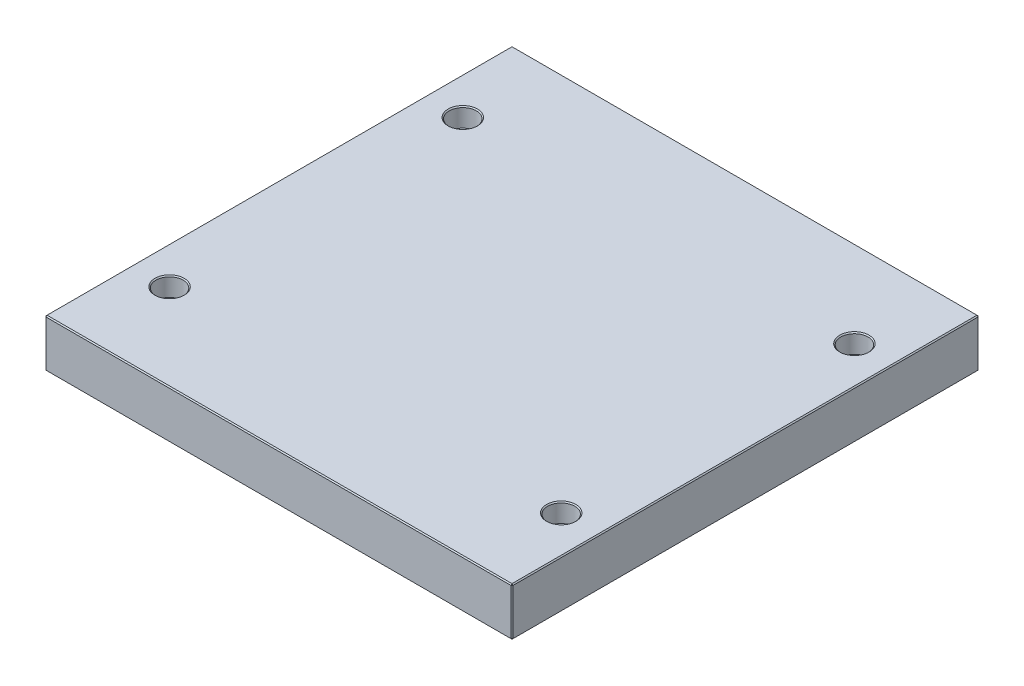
ISO-10303-21;
HEADER;
FILE_DESCRIPTION(('STEP AP214'),'2;1');
FILE_NAME('part.step','',(''),(''),'','','');
FILE_SCHEMA(('AUTOMOTIVE_DESIGN { 1 0 10303 214 1 1 1 1 }'));
ENDSEC;
DATA;
#1=APPLICATION_CONTEXT('core data for automotive mechanical design processes');
#2=APPLICATION_PROTOCOL_DEFINITION('international standard','automotive_design',2000,#1);
#3=PRODUCT_CONTEXT('',#1,'mechanical');
#4=PRODUCT('Part','Part','',(#3));
#5=PRODUCT_RELATED_PRODUCT_CATEGORY('part','',(#4));
#6=PRODUCT_DEFINITION_FORMATION('','',#4);
#7=PRODUCT_DEFINITION_CONTEXT('part definition',#1,'design');
#8=PRODUCT_DEFINITION('design','',#6,#7);
#9=PRODUCT_DEFINITION_SHAPE('','',#8);
#10=(LENGTH_UNIT() NAMED_UNIT(*) SI_UNIT(.MILLI.,.METRE.));
#11=(NAMED_UNIT(*) PLANE_ANGLE_UNIT() SI_UNIT($,.RADIAN.));
#12=(NAMED_UNIT(*) SI_UNIT($,.STERADIAN.) SOLID_ANGLE_UNIT());
#13=UNCERTAINTY_MEASURE_WITH_UNIT(LENGTH_MEASURE(1.E-05),#10,'distance_accuracy_value','');
#14=(GEOMETRIC_REPRESENTATION_CONTEXT(3) GLOBAL_UNCERTAINTY_ASSIGNED_CONTEXT((#13)) GLOBAL_UNIT_ASSIGNED_CONTEXT((#10,
#11,#12)) REPRESENTATION_CONTEXT('',''));
#15=CARTESIAN_POINT('',(0.,0.,0.));
#16=DIRECTION('',(0.,0.,1.));
#17=DIRECTION('',(1.,0.,0.));
#18=AXIS2_PLACEMENT_3D('',#15,#16,#17);
#19=CARTESIAN_POINT('',(-223.,46.,223.));
#20=DIRECTION('',(1.,0.,0.));
#21=DIRECTION('',(0.,0.,-1.));
#22=AXIS2_PLACEMENT_3D('',#19,#20,#21);
#23=PLANE('',#22);
#24=DIRECTION('',(0.,-1.,0.));
#25=VECTOR('',#24,1.);
#26=CARTESIAN_POINT('',(-223.,46.,-222.));
#27=LINE('',#26,#25);
#28=CARTESIAN_POINT('',(-223.,45.,-222.));
#29=VERTEX_POINT('',#28);
#30=CARTESIAN_POINT('',(-223.,1.,-222.));
#31=VERTEX_POINT('',#30);
#32=EDGE_CURVE('E115',#29,#31,#27,.T.);
#33=ORIENTED_EDGE('',*,*,#32,.T.);
#34=DIRECTION('',(0.,0.,1.));
#35=VECTOR('',#34,1.);
#36=CARTESIAN_POINT('',(-223.,1.,223.));
#37=LINE('',#36,#35);
#38=CARTESIAN_POINT('',(-223.,1.,222.));
#39=VERTEX_POINT('',#38);
#40=EDGE_CURVE('E111',#31,#39,#37,.T.);
#41=ORIENTED_EDGE('',*,*,#40,.T.);
#42=DIRECTION('',(0.,1.,0.));
#43=VECTOR('',#42,1.);
#44=CARTESIAN_POINT('',(-223.,46.,222.));
#45=LINE('',#44,#43);
#46=CARTESIAN_POINT('',(-223.,45.,222.));
#47=VERTEX_POINT('',#46);
#48=EDGE_CURVE('E104',#39,#47,#45,.T.);
#49=ORIENTED_EDGE('',*,*,#48,.T.);
#50=DIRECTION('',(0.,0.,-1.));
#51=VECTOR('',#50,1.);
#52=CARTESIAN_POINT('',(-223.,45.,-223.));
#53=LINE('',#52,#51);
#54=EDGE_CURVE('E108',#47,#29,#53,.T.);
#55=ORIENTED_EDGE('',*,*,#54,.T.);
#56=EDGE_LOOP('',(#33,#41,#49,#55));
#57=FACE_BOUND('',#56,.T.);
#58=ADVANCED_FACE('F16',(#57),#23,.F.);
#59=CARTESIAN_POINT('',(223.,46.,223.));
#60=DIRECTION('',(0.,0.,-1.));
#61=DIRECTION('',(-1.,0.,0.));
#62=AXIS2_PLACEMENT_3D('',#59,#60,#61);
#63=PLANE('',#62);
#64=DIRECTION('',(-1.,0.,0.));
#65=VECTOR('',#64,1.);
#66=CARTESIAN_POINT('',(-223.,45.,223.));
#67=LINE('',#66,#65);
#68=CARTESIAN_POINT('',(222.,45.,223.));
#69=VERTEX_POINT('',#68);
#70=CARTESIAN_POINT('',(-222.,45.,223.));
#71=VERTEX_POINT('',#70);
#72=EDGE_CURVE('E170',#69,#71,#67,.T.);
#73=ORIENTED_EDGE('',*,*,#72,.T.);
#74=DIRECTION('',(0.,-1.,0.));
#75=VECTOR('',#74,1.);
#76=CARTESIAN_POINT('',(-222.,46.,223.));
#77=LINE('',#76,#75);
#78=CARTESIAN_POINT('',(-222.,1.,223.));
#79=VERTEX_POINT('',#78);
#80=EDGE_CURVE('E123',#71,#79,#77,.T.);
#81=ORIENTED_EDGE('',*,*,#80,.T.);
#82=DIRECTION('',(1.,0.,0.));
#83=VECTOR('',#82,1.);
#84=CARTESIAN_POINT('',(223.,1.,223.));
#85=LINE('',#84,#83);
#86=CARTESIAN_POINT('',(222.,1.,223.));
#87=VERTEX_POINT('',#86);
#88=EDGE_CURVE('E174',#79,#87,#85,.T.);
#89=ORIENTED_EDGE('',*,*,#88,.T.);
#90=DIRECTION('',(0.,1.,0.));
#91=VECTOR('',#90,1.);
#92=CARTESIAN_POINT('',(222.,46.,223.));
#93=LINE('',#92,#91);
#94=EDGE_CURVE('E172',#87,#69,#93,.T.);
#95=ORIENTED_EDGE('',*,*,#94,.T.);
#96=EDGE_LOOP('',(#73,#81,#89,#95));
#97=FACE_BOUND('',#96,.T.);
#98=ADVANCED_FACE('F317',(#97),#63,.F.);
#99=CARTESIAN_POINT('',(223.,46.,223.));
#100=DIRECTION('',(-1.,0.,0.));
#101=DIRECTION('',(0.,0.,1.));
#102=AXIS2_PLACEMENT_3D('',#99,#100,#101);
#103=PLANE('',#102);
#104=DIRECTION('',(0.,0.,-1.));
#105=VECTOR('',#104,1.);
#106=CARTESIAN_POINT('',(223.,1.,223.));
#107=LINE('',#106,#105);
#108=CARTESIAN_POINT('',(223.,1.,222.));
#109=VERTEX_POINT('',#108);
#110=CARTESIAN_POINT('',(223.,1.,-222.));
#111=VERTEX_POINT('',#110);
#112=EDGE_CURVE('E165',#109,#111,#107,.T.);
#113=ORIENTED_EDGE('',*,*,#112,.T.);
#114=DIRECTION('',(0.,1.,0.));
#115=VECTOR('',#114,1.);
#116=CARTESIAN_POINT('',(223.,46.,-222.));
#117=LINE('',#116,#115);
#118=CARTESIAN_POINT('',(223.,45.,-222.));
#119=VERTEX_POINT('',#118);
#120=EDGE_CURVE('E167',#111,#119,#117,.T.);
#121=ORIENTED_EDGE('',*,*,#120,.T.);
#122=DIRECTION('',(0.,0.,1.));
#123=VECTOR('',#122,1.);
#124=CARTESIAN_POINT('',(223.,45.,223.));
#125=LINE('',#124,#123);
#126=CARTESIAN_POINT('',(223.,45.,222.));
#127=VERTEX_POINT('',#126);
#128=EDGE_CURVE('E161',#119,#127,#125,.T.);
#129=ORIENTED_EDGE('',*,*,#128,.T.);
#130=DIRECTION('',(0.,-1.,0.));
#131=VECTOR('',#130,1.);
#132=CARTESIAN_POINT('',(223.,46.,222.));
#133=LINE('',#132,#131);
#134=EDGE_CURVE('E163',#127,#109,#133,.T.);
#135=ORIENTED_EDGE('',*,*,#134,.T.);
#136=EDGE_LOOP('',(#113,#121,#129,#135));
#137=FACE_BOUND('',#136,.T.);
#138=ADVANCED_FACE('F323',(#137),#103,.F.);
#139=CARTESIAN_POINT('',(223.,46.,-223.));
#140=DIRECTION('',(0.,0.,1.));
#141=DIRECTION('',(1.,0.,0.));
#142=AXIS2_PLACEMENT_3D('',#139,#140,#141);
#143=PLANE('',#142);
#144=DIRECTION('',(0.,-1.,0.));
#145=VECTOR('',#144,1.);
#146=CARTESIAN_POINT('',(222.,46.,-223.));
#147=LINE('',#146,#145);
#148=CARTESIAN_POINT('',(222.,45.,-223.));
#149=VERTEX_POINT('',#148);
#150=CARTESIAN_POINT('',(222.,1.,-223.));
#151=VERTEX_POINT('',#150);
#152=EDGE_CURVE('E154',#149,#151,#147,.T.);
#153=ORIENTED_EDGE('',*,*,#152,.T.);
#154=DIRECTION('',(-1.,0.,0.));
#155=VECTOR('',#154,1.);
#156=CARTESIAN_POINT('',(223.,1.,-223.));
#157=LINE('',#156,#155);
#158=CARTESIAN_POINT('',(-222.,1.,-223.));
#159=VERTEX_POINT('',#158);
#160=EDGE_CURVE('E159',#151,#159,#157,.T.);
#161=ORIENTED_EDGE('',*,*,#160,.T.);
#162=DIRECTION('',(0.,1.,0.));
#163=VECTOR('',#162,1.);
#164=CARTESIAN_POINT('',(-222.,46.,-223.));
#165=LINE('',#164,#163);
#166=CARTESIAN_POINT('',(-222.,45.,-223.));
#167=VERTEX_POINT('',#166);
#168=EDGE_CURVE('E156',#159,#167,#165,.T.);
#169=ORIENTED_EDGE('',*,*,#168,.T.);
#170=DIRECTION('',(1.,0.,0.));
#171=VECTOR('',#170,1.);
#172=CARTESIAN_POINT('',(223.,45.,-223.));
#173=LINE('',#172,#171);
#174=EDGE_CURVE('E152',#167,#149,#173,.T.);
#175=ORIENTED_EDGE('',*,*,#174,.T.);
#176=EDGE_LOOP('',(#153,#161,#169,#175));
#177=FACE_BOUND('',#176,.T.);
#178=ADVANCED_FACE('F465',(#177),#143,.F.);
#179=CARTESIAN_POINT('',(0.,46.,0.));
#180=DIRECTION('',(0.,1.,0.));
#181=DIRECTION('',(0.,0.,1.));
#182=AXIS2_PLACEMENT_3D('',#179,#180,#181);
#183=PLANE('',#182);
#184=CARTESIAN_POINT('',(-187.,46.,140.));
#185=DIRECTION('',(0.,1.,0.));
#186=DIRECTION('',(0.,0.,1.));
#187=AXIS2_PLACEMENT_3D('',#184,#185,#186);
#188=CIRCLE('',#187,14.);
#189=CARTESIAN_POINT('',(-187.,46.,154.));
#190=VERTEX_POINT('',#189);
#191=EDGE_CURVE('E290',#190,#190,#188,.F.);
#192=ORIENTED_EDGE('',*,*,#191,.T.);
#193=EDGE_LOOP('',(#192));
#194=FACE_BOUND('',#193,.T.);
#195=CARTESIAN_POINT('',(187.,46.,140.));
#196=DIRECTION('',(0.,1.,0.));
#197=DIRECTION('',(0.,0.,1.));
#198=AXIS2_PLACEMENT_3D('',#195,#196,#197);
#199=CIRCLE('',#198,14.);
#200=CARTESIAN_POINT('',(187.,46.,154.));
#201=VERTEX_POINT('',#200);
#202=EDGE_CURVE('E287',#201,#201,#199,.F.);
#203=ORIENTED_EDGE('',*,*,#202,.T.);
#204=EDGE_LOOP('',(#203));
#205=FACE_BOUND('',#204,.T.);
#206=CARTESIAN_POINT('',(187.,46.,-140.));
#207=DIRECTION('',(0.,1.,0.));
#208=DIRECTION('',(0.,0.,1.));
#209=AXIS2_PLACEMENT_3D('',#206,#207,#208);
#210=CIRCLE('',#209,14.);
#211=CARTESIAN_POINT('',(187.,46.,-126.));
#212=VERTEX_POINT('',#211);
#213=EDGE_CURVE('E284',#212,#212,#210,.F.);
#214=ORIENTED_EDGE('',*,*,#213,.T.);
#215=EDGE_LOOP('',(#214));
#216=FACE_BOUND('',#215,.T.);
#217=CARTESIAN_POINT('',(-187.,46.,-140.));
#218=DIRECTION('',(0.,1.,0.));
#219=DIRECTION('',(0.,0.,1.));
#220=AXIS2_PLACEMENT_3D('',#217,#218,#219);
#221=CIRCLE('',#220,14.);
#222=CARTESIAN_POINT('',(-187.,46.,-126.));
#223=VERTEX_POINT('',#222);
#224=EDGE_CURVE('E281',#223,#223,#221,.F.);
#225=ORIENTED_EDGE('',*,*,#224,.T.);
#226=EDGE_LOOP('',(#225));
#227=FACE_BOUND('',#226,.T.);
#228=DIRECTION('',(0.,0.,-1.));
#229=VECTOR('',#228,1.);
#230=CARTESIAN_POINT('',(222.,46.,-223.));
#231=LINE('',#230,#229);
#232=CARTESIAN_POINT('',(222.,46.,222.));
#233=VERTEX_POINT('',#232);
#234=CARTESIAN_POINT('',(222.,46.,-222.));
#235=VERTEX_POINT('',#234);
#236=EDGE_CURVE('E31',#233,#235,#231,.T.);
#237=ORIENTED_EDGE('',*,*,#236,.T.);
#238=DIRECTION('',(-1.,0.,0.));
#239=VECTOR('',#238,1.);
#240=CARTESIAN_POINT('',(-223.,46.,-222.));
#241=LINE('',#240,#239);
#242=CARTESIAN_POINT('',(-222.,46.,-222.));
#243=VERTEX_POINT('',#242);
#244=EDGE_CURVE('E190',#235,#243,#241,.T.);
#245=ORIENTED_EDGE('',*,*,#244,.T.);
#246=DIRECTION('',(0.,0.,1.));
#247=VECTOR('',#246,1.);
#248=CARTESIAN_POINT('',(-222.,46.,223.));
#249=LINE('',#248,#247);
#250=CARTESIAN_POINT('',(-222.,46.,222.));
#251=VERTEX_POINT('',#250);
#252=EDGE_CURVE('E186',#243,#251,#249,.T.);
#253=ORIENTED_EDGE('',*,*,#252,.T.);
#254=DIRECTION('',(1.,0.,0.));
#255=VECTOR('',#254,1.);
#256=CARTESIAN_POINT('',(223.,46.,222.));
#257=LINE('',#256,#255);
#258=EDGE_CURVE('E36',#251,#233,#257,.T.);
#259=ORIENTED_EDGE('',*,*,#258,.T.);
#260=EDGE_LOOP('',(#237,#245,#253,#259));
#261=FACE_BOUND('',#260,.T.);
#262=ADVANCED_FACE('F462',(#194,#205,#216,#227,#261),#183,.T.);
#263=CARTESIAN_POINT('',(0.,0.,0.));
#264=DIRECTION('',(0.,1.,0.));
#265=DIRECTION('',(0.,0.,1.));
#266=AXIS2_PLACEMENT_3D('',#263,#264,#265);
#267=PLANE('',#266);
#268=CARTESIAN_POINT('',(187.,0.,-140.));
#269=DIRECTION('',(0.,1.,0.));
#270=DIRECTION('',(0.,0.,1.));
#271=AXIS2_PLACEMENT_3D('',#268,#269,#270);
#272=CIRCLE('',#271,10.);
#273=CARTESIAN_POINT('',(187.,0.,-130.));
#274=VERTEX_POINT('',#273);
#275=EDGE_CURVE('E263',#274,#274,#272,.T.);
#276=ORIENTED_EDGE('',*,*,#275,.T.);
#277=EDGE_LOOP('',(#276));
#278=FACE_BOUND('',#277,.T.);
#279=CARTESIAN_POINT('',(187.,0.,140.));
#280=DIRECTION('',(0.,1.,0.));
#281=DIRECTION('',(0.,0.,1.));
#282=AXIS2_PLACEMENT_3D('',#279,#280,#281);
#283=CIRCLE('',#282,10.);
#284=CARTESIAN_POINT('',(187.,0.,150.));
#285=VERTEX_POINT('',#284);
#286=EDGE_CURVE('E260',#285,#285,#283,.T.);
#287=ORIENTED_EDGE('',*,*,#286,.T.);
#288=EDGE_LOOP('',(#287));
#289=FACE_BOUND('',#288,.T.);
#290=CARTESIAN_POINT('',(-187.,0.,140.));
#291=DIRECTION('',(0.,1.,0.));
#292=DIRECTION('',(0.,0.,1.));
#293=AXIS2_PLACEMENT_3D('',#290,#291,#292);
#294=CIRCLE('',#293,10.);
#295=CARTESIAN_POINT('',(-187.,0.,150.));
#296=VERTEX_POINT('',#295);
#297=EDGE_CURVE('E257',#296,#296,#294,.T.);
#298=ORIENTED_EDGE('',*,*,#297,.T.);
#299=EDGE_LOOP('',(#298));
#300=FACE_BOUND('',#299,.T.);
#301=CARTESIAN_POINT('',(-187.,0.,-140.));
#302=DIRECTION('',(0.,1.,0.));
#303=DIRECTION('',(0.,0.,1.));
#304=AXIS2_PLACEMENT_3D('',#301,#302,#303);
#305=CIRCLE('',#304,10.);
#306=CARTESIAN_POINT('',(-187.,0.,-130.));
#307=VERTEX_POINT('',#306);
#308=EDGE_CURVE('E192',#307,#307,#305,.T.);
#309=ORIENTED_EDGE('',*,*,#308,.T.);
#310=EDGE_LOOP('',(#309));
#311=FACE_BOUND('',#310,.T.);
#312=DIRECTION('',(0.,0.,1.));
#313=VECTOR('',#312,1.);
#314=CARTESIAN_POINT('',(222.,0.,0.));
#315=LINE('',#314,#313);
#316=CARTESIAN_POINT('',(222.,0.,-222.));
#317=VERTEX_POINT('',#316);
#318=CARTESIAN_POINT('',(222.,0.,222.));
#319=VERTEX_POINT('',#318);
#320=EDGE_CURVE('E177',#317,#319,#315,.T.);
#321=ORIENTED_EDGE('',*,*,#320,.T.);
#322=DIRECTION('',(-1.,0.,0.));
#323=VECTOR('',#322,1.);
#324=CARTESIAN_POINT('',(0.,0.,222.));
#325=LINE('',#324,#323);
#326=CARTESIAN_POINT('',(-222.,0.,222.));
#327=VERTEX_POINT('',#326);
#328=EDGE_CURVE('E183',#319,#327,#325,.T.);
#329=ORIENTED_EDGE('',*,*,#328,.T.);
#330=DIRECTION('',(0.,0.,-1.));
#331=VECTOR('',#330,1.);
#332=CARTESIAN_POINT('',(-222.,0.,0.));
#333=LINE('',#332,#331);
#334=CARTESIAN_POINT('',(-222.,0.,-222.));
#335=VERTEX_POINT('',#334);
#336=EDGE_CURVE('E181',#327,#335,#333,.T.);
#337=ORIENTED_EDGE('',*,*,#336,.T.);
#338=DIRECTION('',(1.,0.,0.));
#339=VECTOR('',#338,1.);
#340=CARTESIAN_POINT('',(0.,0.,-222.));
#341=LINE('',#340,#339);
#342=EDGE_CURVE('E179',#335,#317,#341,.T.);
#343=ORIENTED_EDGE('',*,*,#342,.T.);
#344=EDGE_LOOP('',(#321,#329,#337,#343));
#345=FACE_BOUND('',#344,.T.);
#346=ADVANCED_FACE('F402',(#278,#289,#300,#311,#345),#267,.F.);
#347=CARTESIAN_POINT('',(223.,46.,222.));
#348=DIRECTION('',(-0.707106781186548,0.,-0.707106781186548));
#349=DIRECTION('',(0.,-1.,0.));
#350=AXIS2_PLACEMENT_3D('',#347,#348,#349);
#351=PLANE('',#350);
#352=DIRECTION('',(-0.707106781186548,0.,0.707106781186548));
#353=VECTOR('',#352,1.);
#354=CARTESIAN_POINT('',(222.,45.,223.));
#355=LINE('',#354,#353);
#356=EDGE_CURVE('E141',#69,#127,#355,.F.);
#357=ORIENTED_EDGE('',*,*,#356,.F.);
#358=ORIENTED_EDGE('',*,*,#94,.F.);
#359=DIRECTION('',(0.707106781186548,0.,-0.707106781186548));
#360=VECTOR('',#359,1.);
#361=CARTESIAN_POINT('',(222.,1.,223.));
#362=LINE('',#361,#360);
#363=EDGE_CURVE('E144',#109,#87,#362,.F.);
#364=ORIENTED_EDGE('',*,*,#363,.F.);
#365=ORIENTED_EDGE('',*,*,#134,.F.);
#366=EDGE_LOOP('',(#357,#358,#364,#365));
#367=FACE_BOUND('',#366,.T.);
#368=ADVANCED_FACE('F398',(#367),#351,.F.);
#369=CARTESIAN_POINT('',(222.,45.,223.));
#370=DIRECTION('',(0.577350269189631,0.577350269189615,0.577350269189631));
#371=DIRECTION('',(0.707106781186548,0.,-0.707106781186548));
#372=AXIS2_PLACEMENT_3D('',#369,#370,#371);
#373=PLANE('',#372);
#374=DIRECTION('',(0.,-0.707106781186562,0.707106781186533));
#375=VECTOR('',#374,1.);
#376=CARTESIAN_POINT('',(222.,45.,223.));
#377=LINE('',#376,#375);
#378=EDGE_CURVE('E235',#69,#233,#377,.F.);
#379=ORIENTED_EDGE('',*,*,#378,.F.);
#380=ORIENTED_EDGE('',*,*,#356,.T.);
#381=DIRECTION('',(-0.707106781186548,0.707106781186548,0.));
#382=VECTOR('',#381,1.);
#383=CARTESIAN_POINT('',(222.5,45.5,222.));
#384=LINE('',#383,#382);
#385=EDGE_CURVE('E237',#233,#127,#384,.F.);
#386=ORIENTED_EDGE('',*,*,#385,.F.);
#387=EDGE_LOOP('',(#379,#380,#386));
#388=FACE_BOUND('',#387,.T.);
#389=ADVANCED_FACE('F394',(#388),#373,.T.);
#390=CARTESIAN_POINT('',(222.,1.,223.));
#391=DIRECTION('',(0.577350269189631,-0.577350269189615,0.577350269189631));
#392=DIRECTION('',(0.707106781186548,0.,-0.707106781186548));
#393=AXIS2_PLACEMENT_3D('',#390,#391,#392);
#394=PLANE('',#393);
#395=DIRECTION('',(-0.707106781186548,-0.707106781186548,0.));
#396=VECTOR('',#395,1.);
#397=CARTESIAN_POINT('',(222.5,0.499999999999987,222.));
#398=LINE('',#397,#396);
#399=EDGE_CURVE('E229',#109,#319,#398,.T.);
#400=ORIENTED_EDGE('',*,*,#399,.F.);
#401=ORIENTED_EDGE('',*,*,#363,.T.);
#402=DIRECTION('',(0.,0.707106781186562,0.707106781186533));
#403=VECTOR('',#402,1.);
#404=CARTESIAN_POINT('',(222.,1.,223.));
#405=LINE('',#404,#403);
#406=EDGE_CURVE('E232',#319,#87,#405,.T.);
#407=ORIENTED_EDGE('',*,*,#406,.F.);
#408=EDGE_LOOP('',(#400,#401,#407));
#409=FACE_BOUND('',#408,.T.);
#410=ADVANCED_FACE('F390',(#409),#394,.T.);
#411=CARTESIAN_POINT('',(222.,46.,0.));
#412=DIRECTION('',(0.707106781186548,0.707106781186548,0.));
#413=DIRECTION('',(0.,0.,1.));
#414=AXIS2_PLACEMENT_3D('',#411,#412,#413);
#415=PLANE('',#414);
#416=ORIENTED_EDGE('',*,*,#385,.T.);
#417=ORIENTED_EDGE('',*,*,#128,.F.);
#418=DIRECTION('',(0.707106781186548,-0.707106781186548,0.));
#419=VECTOR('',#418,1.);
#420=CARTESIAN_POINT('',(223.,45.,-222.));
#421=LINE('',#420,#419);
#422=EDGE_CURVE('E224',#235,#119,#421,.T.);
#423=ORIENTED_EDGE('',*,*,#422,.F.);
#424=ORIENTED_EDGE('',*,*,#236,.F.);
#425=EDGE_LOOP('',(#416,#417,#423,#424));
#426=FACE_BOUND('',#425,.T.);
#427=ADVANCED_FACE('F386',(#426),#415,.T.);
#428=CARTESIAN_POINT('',(0.,46.,222.));
#429=DIRECTION('',(0.,0.707106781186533,0.707106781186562));
#430=DIRECTION('',(-1.,0.,0.));
#431=AXIS2_PLACEMENT_3D('',#428,#429,#430);
#432=PLANE('',#431);
#433=ORIENTED_EDGE('',*,*,#378,.T.);
#434=ORIENTED_EDGE('',*,*,#258,.F.);
#435=DIRECTION('',(0.,0.707106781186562,-0.707106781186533));
#436=VECTOR('',#435,1.);
#437=CARTESIAN_POINT('',(-222.,45.5,222.5));
#438=LINE('',#437,#436);
#439=EDGE_CURVE('E127',#71,#251,#438,.T.);
#440=ORIENTED_EDGE('',*,*,#439,.F.);
#441=ORIENTED_EDGE('',*,*,#72,.F.);
#442=EDGE_LOOP('',(#433,#434,#440,#441));
#443=FACE_BOUND('',#442,.T.);
#444=ADVANCED_FACE('F383',(#443),#432,.T.);
#445=CARTESIAN_POINT('',(-222.,46.,223.));
#446=DIRECTION('',(0.707106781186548,0.,-0.707106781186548));
#447=DIRECTION('',(0.,-1.,0.));
#448=AXIS2_PLACEMENT_3D('',#445,#446,#447);
#449=PLANE('',#448);
#450=DIRECTION('',(0.707106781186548,0.,0.707106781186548));
#451=VECTOR('',#450,1.);
#452=CARTESIAN_POINT('',(-222.,1.,223.));
#453=LINE('',#452,#451);
#454=EDGE_CURVE('E128',#79,#39,#453,.F.);
#455=ORIENTED_EDGE('',*,*,#454,.F.);
#456=ORIENTED_EDGE('',*,*,#80,.F.);
#457=DIRECTION('',(-0.707106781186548,0.,-0.707106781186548));
#458=VECTOR('',#457,1.);
#459=CARTESIAN_POINT('',(-223.,45.,222.));
#460=LINE('',#459,#458);
#461=EDGE_CURVE('E119',#47,#71,#460,.F.);
#462=ORIENTED_EDGE('',*,*,#461,.F.);
#463=ORIENTED_EDGE('',*,*,#48,.F.);
#464=EDGE_LOOP('',(#455,#456,#462,#463));
#465=FACE_BOUND('',#464,.T.);
#466=ADVANCED_FACE('F121',(#465),#449,.F.);
#467=CARTESIAN_POINT('',(223.,1.,223.));
#468=DIRECTION('',(0.,0.707106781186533,-0.707106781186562));
#469=DIRECTION('',(1.,0.,0.));
#470=AXIS2_PLACEMENT_3D('',#467,#468,#469);
#471=PLANE('',#470);
#472=ORIENTED_EDGE('',*,*,#406,.T.);
#473=ORIENTED_EDGE('',*,*,#88,.F.);
#474=DIRECTION('',(0.,-0.707106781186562,-0.707106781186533));
#475=VECTOR('',#474,1.);
#476=CARTESIAN_POINT('',(-222.,1.,223.));
#477=LINE('',#476,#475);
#478=EDGE_CURVE('E220',#327,#79,#477,.F.);
#479=ORIENTED_EDGE('',*,*,#478,.F.);
#480=ORIENTED_EDGE('',*,*,#328,.F.);
#481=EDGE_LOOP('',(#472,#473,#479,#480));
#482=FACE_BOUND('',#481,.T.);
#483=ADVANCED_FACE('F376',(#482),#471,.F.);
#484=CARTESIAN_POINT('',(223.,1.,223.));
#485=DIRECTION('',(-0.707106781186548,0.707106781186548,0.));
#486=DIRECTION('',(0.,0.,-1.));
#487=AXIS2_PLACEMENT_3D('',#484,#485,#486);
#488=PLANE('',#487);
#489=ORIENTED_EDGE('',*,*,#399,.T.);
#490=ORIENTED_EDGE('',*,*,#320,.F.);
#491=DIRECTION('',(0.707106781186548,0.707106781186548,0.));
#492=VECTOR('',#491,1.);
#493=CARTESIAN_POINT('',(222.5,0.499999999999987,-222.));
#494=LINE('',#493,#492);
#495=EDGE_CURVE('E217',#111,#317,#494,.F.);
#496=ORIENTED_EDGE('',*,*,#495,.F.);
#497=ORIENTED_EDGE('',*,*,#112,.F.);
#498=EDGE_LOOP('',(#489,#490,#496,#497));
#499=FACE_BOUND('',#498,.T.);
#500=ADVANCED_FACE('F372',(#499),#488,.F.);
#501=CARTESIAN_POINT('',(222.,46.,-223.));
#502=DIRECTION('',(-0.707106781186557,0.,0.707106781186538));
#503=DIRECTION('',(0.,-1.,0.));
#504=AXIS2_PLACEMENT_3D('',#501,#502,#503);
#505=PLANE('',#504);
#506=DIRECTION('',(0.707106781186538,0.,0.707106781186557));
#507=VECTOR('',#506,1.);
#508=CARTESIAN_POINT('',(223.,45.,-222.));
#509=LINE('',#508,#507);
#510=EDGE_CURVE('E226',#119,#149,#509,.F.);
#511=ORIENTED_EDGE('',*,*,#510,.F.);
#512=ORIENTED_EDGE('',*,*,#120,.F.);
#513=DIRECTION('',(-0.707106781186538,0.,-0.707106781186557));
#514=VECTOR('',#513,1.);
#515=CARTESIAN_POINT('',(222.,1.,-223.));
#516=LINE('',#515,#514);
#517=EDGE_CURVE('E214',#151,#111,#516,.F.);
#518=ORIENTED_EDGE('',*,*,#517,.F.);
#519=ORIENTED_EDGE('',*,*,#152,.F.);
#520=EDGE_LOOP('',(#511,#512,#518,#519));
#521=FACE_BOUND('',#520,.T.);
#522=ADVANCED_FACE('F368',(#521),#505,.F.);
#523=CARTESIAN_POINT('',(223.,45.,-222.));
#524=DIRECTION('',(0.577350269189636,0.57735026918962,-0.57735026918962));
#525=DIRECTION('',(-0.707106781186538,0.,-0.707106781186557));
#526=AXIS2_PLACEMENT_3D('',#523,#524,#525);
#527=PLANE('',#526);
#528=ORIENTED_EDGE('',*,*,#422,.T.);
#529=ORIENTED_EDGE('',*,*,#510,.T.);
#530=DIRECTION('',(0.,0.707106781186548,0.707106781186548));
#531=VECTOR('',#530,1.);
#532=CARTESIAN_POINT('',(222.,45.5,-222.5));
#533=LINE('',#532,#531);
#534=EDGE_CURVE('E135',#235,#149,#533,.F.);
#535=ORIENTED_EDGE('',*,*,#534,.F.);
#536=EDGE_LOOP('',(#528,#529,#535));
#537=FACE_BOUND('',#536,.T.);
#538=ADVANCED_FACE('F365',(#537),#527,.T.);
#539=CARTESIAN_POINT('',(-223.,45.,222.));
#540=DIRECTION('',(-0.577350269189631,0.577350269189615,0.577350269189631));
#541=DIRECTION('',(0.707106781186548,0.,0.707106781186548));
#542=AXIS2_PLACEMENT_3D('',#539,#540,#541);
#543=PLANE('',#542);
#544=ORIENTED_EDGE('',*,*,#461,.T.);
#545=ORIENTED_EDGE('',*,*,#439,.T.);
#546=DIRECTION('',(-0.707106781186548,-0.707106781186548,0.));
#547=VECTOR('',#546,1.);
#548=CARTESIAN_POINT('',(-223.,45.,222.));
#549=LINE('',#548,#547);
#550=EDGE_CURVE('E131',#47,#251,#549,.F.);
#551=ORIENTED_EDGE('',*,*,#550,.F.);
#552=EDGE_LOOP('',(#544,#545,#551));
#553=FACE_BOUND('',#552,.T.);
#554=ADVANCED_FACE('F132',(#553),#543,.T.);
#555=CARTESIAN_POINT('',(-222.,1.,223.));
#556=DIRECTION('',(-0.577350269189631,-0.577350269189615,0.577350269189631));
#557=DIRECTION('',(0.707106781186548,0.,0.707106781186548));
#558=AXIS2_PLACEMENT_3D('',#555,#556,#557);
#559=PLANE('',#558);
#560=ORIENTED_EDGE('',*,*,#478,.T.);
#561=ORIENTED_EDGE('',*,*,#454,.T.);
#562=DIRECTION('',(-0.707106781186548,0.707106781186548,0.));
#563=VECTOR('',#562,1.);
#564=CARTESIAN_POINT('',(-222.5,0.499999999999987,222.));
#565=LINE('',#564,#563);
#566=EDGE_CURVE('E136',#327,#39,#565,.T.);
#567=ORIENTED_EDGE('',*,*,#566,.F.);
#568=EDGE_LOOP('',(#560,#561,#567));
#569=FACE_BOUND('',#568,.T.);
#570=ADVANCED_FACE('F358',(#569),#559,.T.);
#571=CARTESIAN_POINT('',(222.,1.,-223.));
#572=DIRECTION('',(0.577350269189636,-0.57735026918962,-0.57735026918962));
#573=DIRECTION('',(-0.707106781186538,0.,-0.707106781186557));
#574=AXIS2_PLACEMENT_3D('',#571,#572,#573);
#575=PLANE('',#574);
#576=ORIENTED_EDGE('',*,*,#517,.T.);
#577=ORIENTED_EDGE('',*,*,#495,.T.);
#578=DIRECTION('',(0.,-0.707106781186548,0.707106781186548));
#579=VECTOR('',#578,1.);
#580=CARTESIAN_POINT('',(222.,1.,-223.));
#581=LINE('',#580,#579);
#582=EDGE_CURVE('E207',#151,#317,#581,.T.);
#583=ORIENTED_EDGE('',*,*,#582,.F.);
#584=EDGE_LOOP('',(#576,#577,#583));
#585=FACE_BOUND('',#584,.T.);
#586=ADVANCED_FACE('F354',(#585),#575,.T.);
#587=CARTESIAN_POINT('',(0.,46.,-222.));
#588=DIRECTION('',(0.,0.707106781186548,-0.707106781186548));
#589=DIRECTION('',(1.,0.,0.));
#590=AXIS2_PLACEMENT_3D('',#587,#588,#589);
#591=PLANE('',#590);
#592=ORIENTED_EDGE('',*,*,#534,.T.);
#593=ORIENTED_EDGE('',*,*,#174,.F.);
#594=DIRECTION('',(0.,-0.707106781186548,-0.707106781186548));
#595=VECTOR('',#594,1.);
#596=CARTESIAN_POINT('',(-222.,45.,-223.));
#597=LINE('',#596,#595);
#598=EDGE_CURVE('E204',#243,#167,#597,.T.);
#599=ORIENTED_EDGE('',*,*,#598,.F.);
#600=ORIENTED_EDGE('',*,*,#244,.F.);
#601=EDGE_LOOP('',(#592,#593,#599,#600));
#602=FACE_BOUND('',#601,.T.);
#603=ADVANCED_FACE('F351',(#602),#591,.T.);
#604=CARTESIAN_POINT('',(-222.,46.,0.));
#605=DIRECTION('',(-0.707106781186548,0.707106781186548,0.));
#606=DIRECTION('',(0.,0.,-1.));
#607=AXIS2_PLACEMENT_3D('',#604,#605,#606);
#608=PLANE('',#607);
#609=ORIENTED_EDGE('',*,*,#550,.T.);
#610=ORIENTED_EDGE('',*,*,#252,.F.);
#611=DIRECTION('',(0.707106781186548,0.707106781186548,0.));
#612=VECTOR('',#611,1.);
#613=CARTESIAN_POINT('',(-222.5,45.5,-222.));
#614=LINE('',#613,#612);
#615=EDGE_CURVE('E139',#29,#243,#614,.T.);
#616=ORIENTED_EDGE('',*,*,#615,.F.);
#617=ORIENTED_EDGE('',*,*,#54,.F.);
#618=EDGE_LOOP('',(#609,#610,#616,#617));
#619=FACE_BOUND('',#618,.T.);
#620=ADVANCED_FACE('F138',(#619),#608,.T.);
#621=CARTESIAN_POINT('',(-223.,1.,223.));
#622=DIRECTION('',(0.707106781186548,0.707106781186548,0.));
#623=DIRECTION('',(0.,0.,1.));
#624=AXIS2_PLACEMENT_3D('',#621,#622,#623);
#625=PLANE('',#624);
#626=ORIENTED_EDGE('',*,*,#566,.T.);
#627=ORIENTED_EDGE('',*,*,#40,.F.);
#628=DIRECTION('',(0.707106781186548,-0.707106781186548,0.));
#629=VECTOR('',#628,1.);
#630=CARTESIAN_POINT('',(-223.,1.,-222.));
#631=LINE('',#630,#629);
#632=EDGE_CURVE('E200',#335,#31,#631,.F.);
#633=ORIENTED_EDGE('',*,*,#632,.F.);
#634=ORIENTED_EDGE('',*,*,#336,.F.);
#635=EDGE_LOOP('',(#626,#627,#633,#634));
#636=FACE_BOUND('',#635,.T.);
#637=ADVANCED_FACE('F344',(#636),#625,.F.);
#638=CARTESIAN_POINT('',(223.,1.,-223.));
#639=DIRECTION('',(0.,0.707106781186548,0.707106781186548));
#640=DIRECTION('',(-1.,0.,0.));
#641=AXIS2_PLACEMENT_3D('',#638,#639,#640);
#642=PLANE('',#641);
#643=ORIENTED_EDGE('',*,*,#582,.T.);
#644=ORIENTED_EDGE('',*,*,#342,.F.);
#645=DIRECTION('',(0.,0.707106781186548,-0.707106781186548));
#646=VECTOR('',#645,1.);
#647=CARTESIAN_POINT('',(-222.,0.5,-222.5));
#648=LINE('',#647,#646);
#649=EDGE_CURVE('E197',#159,#335,#648,.F.);
#650=ORIENTED_EDGE('',*,*,#649,.F.);
#651=ORIENTED_EDGE('',*,*,#160,.F.);
#652=EDGE_LOOP('',(#643,#644,#650,#651));
#653=FACE_BOUND('',#652,.T.);
#654=ADVANCED_FACE('F340',(#653),#642,.F.);
#655=CARTESIAN_POINT('',(-222.,45.,-223.));
#656=DIRECTION('',(-0.577350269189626,0.577350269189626,-0.577350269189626));
#657=DIRECTION('',(-0.707106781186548,0.,0.707106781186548));
#658=AXIS2_PLACEMENT_3D('',#655,#656,#657);
#659=PLANE('',#658);
#660=ORIENTED_EDGE('',*,*,#615,.T.);
#661=ORIENTED_EDGE('',*,*,#598,.T.);
#662=DIRECTION('',(0.707106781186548,0.,-0.707106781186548));
#663=VECTOR('',#662,1.);
#664=CARTESIAN_POINT('',(-222.,45.,-223.));
#665=LINE('',#664,#663);
#666=EDGE_CURVE('E195',#29,#167,#665,.T.);
#667=ORIENTED_EDGE('',*,*,#666,.F.);
#668=EDGE_LOOP('',(#660,#661,#667));
#669=FACE_BOUND('',#668,.T.);
#670=ADVANCED_FACE('F336',(#669),#659,.T.);
#671=CARTESIAN_POINT('',(-223.,1.,-222.));
#672=DIRECTION('',(-0.577350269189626,-0.577350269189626,-0.577350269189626));
#673=DIRECTION('',(-0.707106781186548,0.,0.707106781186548));
#674=AXIS2_PLACEMENT_3D('',#671,#672,#673);
#675=PLANE('',#674);
#676=ORIENTED_EDGE('',*,*,#649,.T.);
#677=ORIENTED_EDGE('',*,*,#632,.T.);
#678=DIRECTION('',(-0.707106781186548,0.,0.707106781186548));
#679=VECTOR('',#678,1.);
#680=CARTESIAN_POINT('',(-223.,1.,-222.));
#681=LINE('',#680,#679);
#682=EDGE_CURVE('E193',#159,#31,#681,.T.);
#683=ORIENTED_EDGE('',*,*,#682,.F.);
#684=EDGE_LOOP('',(#676,#677,#683));
#685=FACE_BOUND('',#684,.T.);
#686=ADVANCED_FACE('F332',(#685),#675,.T.);
#687=CARTESIAN_POINT('',(-223.,46.,-222.));
#688=DIRECTION('',(0.707106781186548,0.,0.707106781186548));
#689=DIRECTION('',(0.,-1.,0.));
#690=AXIS2_PLACEMENT_3D('',#687,#688,#689);
#691=PLANE('',#690);
#692=ORIENTED_EDGE('',*,*,#666,.T.);
#693=ORIENTED_EDGE('',*,*,#168,.F.);
#694=ORIENTED_EDGE('',*,*,#682,.T.);
#695=ORIENTED_EDGE('',*,*,#32,.F.);
#696=EDGE_LOOP('',(#692,#693,#694,#695));
#697=FACE_BOUND('',#696,.T.);
#698=ADVANCED_FACE('F328',(#697),#691,.F.);
#699=CARTESIAN_POINT('',(-187.,28.,-140.));
#700=DIRECTION('',(0.,1.,0.));
#701=DIRECTION('',(0.,0.,1.));
#702=AXIS2_PLACEMENT_3D('',#699,#700,#701);
#703=CYLINDRICAL_SURFACE('',#702,13.);
#704=CARTESIAN_POINT('',(-187.,45.,-140.));
#705=DIRECTION('',(0.,1.,0.));
#706=DIRECTION('',(0.,0.,1.));
#707=AXIS2_PLACEMENT_3D('',#704,#705,#706);
#708=CIRCLE('',#707,13.);
#709=CARTESIAN_POINT('',(-187.,45.,-127.));
#710=VERTEX_POINT('',#709);
#711=EDGE_CURVE('E10',#710,#710,#708,.T.);
#712=ORIENTED_EDGE('',*,*,#711,.T.);
#713=EDGE_LOOP('',(#712));
#714=FACE_BOUND('',#713,.T.);
#715=CARTESIAN_POINT('',(-187.,28.,-140.));
#716=DIRECTION('',(0.,1.,0.));
#717=DIRECTION('',(0.,0.,1.));
#718=AXIS2_PLACEMENT_3D('',#715,#716,#717);
#719=CIRCLE('',#718,13.);
#720=CARTESIAN_POINT('',(-187.,28.,-127.));
#721=VERTEX_POINT('',#720);
#722=EDGE_CURVE('E147',#721,#721,#719,.T.);
#723=ORIENTED_EDGE('',*,*,#722,.F.);
#724=EDGE_LOOP('',(#723));
#725=FACE_BOUND('',#724,.T.);
#726=ADVANCED_FACE('F331',(#714,#725),#703,.F.);
#727=CARTESIAN_POINT('',(-187.,28.,-140.));
#728=DIRECTION('',(0.,1.,0.));
#729=DIRECTION('',(0.,0.,1.));
#730=AXIS2_PLACEMENT_3D('',#727,#728,#729);
#731=PLANE('',#730);
#732=CARTESIAN_POINT('',(-187.,28.,-140.));
#733=DIRECTION('',(0.,1.,0.));
#734=DIRECTION('',(0.,0.,1.));
#735=AXIS2_PLACEMENT_3D('',#732,#733,#734);
#736=CIRCLE('',#735,9.);
#737=CARTESIAN_POINT('',(-187.,28.,-131.));
#738=VERTEX_POINT('',#737);
#739=EDGE_CURVE('E251',#738,#738,#736,.T.);
#740=ORIENTED_EDGE('',*,*,#739,.F.);
#741=EDGE_LOOP('',(#740));
#742=FACE_BOUND('',#741,.T.);
#743=ORIENTED_EDGE('',*,*,#722,.T.);
#744=EDGE_LOOP('',(#743));
#745=FACE_BOUND('',#744,.T.);
#746=ADVANCED_FACE('F450',(#742,#745),#731,.T.);
#747=CARTESIAN_POINT('',(187.,28.,-140.));
#748=DIRECTION('',(0.,1.,0.));
#749=DIRECTION('',(0.,0.,1.));
#750=AXIS2_PLACEMENT_3D('',#747,#748,#749);
#751=CYLINDRICAL_SURFACE('',#750,13.);
#752=CARTESIAN_POINT('',(187.,45.,-140.));
#753=DIRECTION('',(0.,1.,0.));
#754=DIRECTION('',(0.,0.,1.));
#755=AXIS2_PLACEMENT_3D('',#752,#753,#754);
#756=CIRCLE('',#755,13.);
#757=CARTESIAN_POINT('',(187.,45.,-127.));
#758=VERTEX_POINT('',#757);
#759=EDGE_CURVE('E24',#758,#758,#756,.T.);
#760=ORIENTED_EDGE('',*,*,#759,.T.);
#761=EDGE_LOOP('',(#760));
#762=FACE_BOUND('',#761,.T.);
#763=CARTESIAN_POINT('',(187.,28.,-140.));
#764=DIRECTION('',(0.,1.,0.));
#765=DIRECTION('',(0.,0.,1.));
#766=AXIS2_PLACEMENT_3D('',#763,#764,#765);
#767=CIRCLE('',#766,13.);
#768=CARTESIAN_POINT('',(187.,28.,-127.));
#769=VERTEX_POINT('',#768);
#770=EDGE_CURVE('E441',#769,#769,#767,.T.);
#771=ORIENTED_EDGE('',*,*,#770,.F.);
#772=EDGE_LOOP('',(#771));
#773=FACE_BOUND('',#772,.T.);
#774=ADVANCED_FACE('F298',(#762,#773),#751,.F.);
#775=CARTESIAN_POINT('',(187.,28.,-140.));
#776=DIRECTION('',(0.,1.,0.));
#777=DIRECTION('',(0.,0.,1.));
#778=AXIS2_PLACEMENT_3D('',#775,#776,#777);
#779=PLANE('',#778);
#780=CARTESIAN_POINT('',(187.,28.,-140.));
#781=DIRECTION('',(0.,1.,0.));
#782=DIRECTION('',(0.,0.,1.));
#783=AXIS2_PLACEMENT_3D('',#780,#781,#782);
#784=CIRCLE('',#783,9.);
#785=CARTESIAN_POINT('',(187.,28.,-131.));
#786=VERTEX_POINT('',#785);
#787=EDGE_CURVE('E248',#786,#786,#784,.T.);
#788=ORIENTED_EDGE('',*,*,#787,.F.);
#789=EDGE_LOOP('',(#788));
#790=FACE_BOUND('',#789,.T.);
#791=ORIENTED_EDGE('',*,*,#770,.T.);
#792=EDGE_LOOP('',(#791));
#793=FACE_BOUND('',#792,.T.);
#794=ADVANCED_FACE('F738',(#790,#793),#779,.T.);
#795=CARTESIAN_POINT('',(187.,28.,140.));
#796=DIRECTION('',(0.,1.,0.));
#797=DIRECTION('',(0.,0.,1.));
#798=AXIS2_PLACEMENT_3D('',#795,#796,#797);
#799=CYLINDRICAL_SURFACE('',#798,13.);
#800=CARTESIAN_POINT('',(187.,45.,140.));
#801=DIRECTION('',(0.,1.,0.));
#802=DIRECTION('',(0.,0.,1.));
#803=AXIS2_PLACEMENT_3D('',#800,#801,#802);
#804=CIRCLE('',#803,13.);
#805=CARTESIAN_POINT('',(187.,45.,153.));
#806=VERTEX_POINT('',#805);
#807=EDGE_CURVE('E293',#806,#806,#804,.T.);
#808=ORIENTED_EDGE('',*,*,#807,.T.);
#809=EDGE_LOOP('',(#808));
#810=FACE_BOUND('',#809,.T.);
#811=CARTESIAN_POINT('',(187.,28.,140.));
#812=DIRECTION('',(0.,1.,0.));
#813=DIRECTION('',(0.,0.,1.));
#814=AXIS2_PLACEMENT_3D('',#811,#812,#813);
#815=CIRCLE('',#814,13.);
#816=CARTESIAN_POINT('',(187.,28.,153.));
#817=VERTEX_POINT('',#816);
#818=EDGE_CURVE('E439',#817,#817,#815,.T.);
#819=ORIENTED_EDGE('',*,*,#818,.F.);
#820=EDGE_LOOP('',(#819));
#821=FACE_BOUND('',#820,.T.);
#822=ADVANCED_FACE('F730',(#810,#821),#799,.F.);
#823=CARTESIAN_POINT('',(187.,28.,140.));
#824=DIRECTION('',(0.,1.,0.));
#825=DIRECTION('',(0.,0.,1.));
#826=AXIS2_PLACEMENT_3D('',#823,#824,#825);
#827=PLANE('',#826);
#828=CARTESIAN_POINT('',(187.,28.,140.));
#829=DIRECTION('',(0.,1.,0.));
#830=DIRECTION('',(0.,0.,1.));
#831=AXIS2_PLACEMENT_3D('',#828,#829,#830);
#832=CIRCLE('',#831,9.);
#833=CARTESIAN_POINT('',(187.,28.,149.));
#834=VERTEX_POINT('',#833);
#835=EDGE_CURVE('E245',#834,#834,#832,.T.);
#836=ORIENTED_EDGE('',*,*,#835,.F.);
#837=EDGE_LOOP('',(#836));
#838=FACE_BOUND('',#837,.T.);
#839=ORIENTED_EDGE('',*,*,#818,.T.);
#840=EDGE_LOOP('',(#839));
#841=FACE_BOUND('',#840,.T.);
#842=ADVANCED_FACE('F434',(#838,#841),#827,.T.);
#843=CARTESIAN_POINT('',(-187.,28.,140.));
#844=DIRECTION('',(0.,1.,0.));
#845=DIRECTION('',(0.,0.,1.));
#846=AXIS2_PLACEMENT_3D('',#843,#844,#845);
#847=CYLINDRICAL_SURFACE('',#846,13.);
#848=CARTESIAN_POINT('',(-187.,45.,140.));
#849=DIRECTION('',(0.,1.,0.));
#850=DIRECTION('',(0.,0.,1.));
#851=AXIS2_PLACEMENT_3D('',#848,#849,#850);
#852=CIRCLE('',#851,13.);
#853=CARTESIAN_POINT('',(-187.,45.,153.));
#854=VERTEX_POINT('',#853);
#855=EDGE_CURVE('E278',#854,#854,#852,.T.);
#856=ORIENTED_EDGE('',*,*,#855,.T.);
#857=EDGE_LOOP('',(#856));
#858=FACE_BOUND('',#857,.T.);
#859=CARTESIAN_POINT('',(-187.,28.,140.));
#860=DIRECTION('',(0.,1.,0.));
#861=DIRECTION('',(0.,0.,1.));
#862=AXIS2_PLACEMENT_3D('',#859,#860,#861);
#863=CIRCLE('',#862,13.);
#864=CARTESIAN_POINT('',(-187.,28.,153.));
#865=VERTEX_POINT('',#864);
#866=EDGE_CURVE('E254',#865,#865,#863,.T.);
#867=ORIENTED_EDGE('',*,*,#866,.F.);
#868=EDGE_LOOP('',(#867));
#869=FACE_BOUND('',#868,.T.);
#870=ADVANCED_FACE('F430',(#858,#869),#847,.F.);
#871=CARTESIAN_POINT('',(-187.,28.,140.));
#872=DIRECTION('',(0.,1.,0.));
#873=DIRECTION('',(0.,0.,1.));
#874=AXIS2_PLACEMENT_3D('',#871,#872,#873);
#875=PLANE('',#874);
#876=CARTESIAN_POINT('',(-187.,28.,140.));
#877=DIRECTION('',(0.,1.,0.));
#878=DIRECTION('',(0.,0.,1.));
#879=AXIS2_PLACEMENT_3D('',#876,#877,#878);
#880=CIRCLE('',#879,9.);
#881=CARTESIAN_POINT('',(-187.,28.,149.));
#882=VERTEX_POINT('',#881);
#883=EDGE_CURVE('E242',#882,#882,#880,.T.);
#884=ORIENTED_EDGE('',*,*,#883,.F.);
#885=EDGE_LOOP('',(#884));
#886=FACE_BOUND('',#885,.T.);
#887=ORIENTED_EDGE('',*,*,#866,.T.);
#888=EDGE_LOOP('',(#887));
#889=FACE_BOUND('',#888,.T.);
#890=ADVANCED_FACE('F433',(#886,#889),#875,.T.);
#891=CARTESIAN_POINT('',(-187.,0.,140.));
#892=DIRECTION('',(0.,1.,0.));
#893=DIRECTION('',(0.,0.,1.));
#894=AXIS2_PLACEMENT_3D('',#891,#892,#893);
#895=CYLINDRICAL_SURFACE('',#894,9.);
#896=CARTESIAN_POINT('',(-187.,0.999999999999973,140.));
#897=DIRECTION('',(0.,1.,0.));
#898=DIRECTION('',(0.,0.,1.));
#899=AXIS2_PLACEMENT_3D('',#896,#897,#898);
#900=CIRCLE('',#899,9.);
#901=CARTESIAN_POINT('',(-187.,0.999999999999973,149.));
#902=VERTEX_POINT('',#901);
#903=EDGE_CURVE('E272',#902,#902,#900,.F.);
#904=ORIENTED_EDGE('',*,*,#903,.T.);
#905=EDGE_LOOP('',(#904));
#906=FACE_BOUND('',#905,.T.);
#907=ORIENTED_EDGE('',*,*,#883,.T.);
#908=EDGE_LOOP('',(#907));
#909=FACE_BOUND('',#908,.T.);
#910=ADVANCED_FACE('F705',(#906,#909),#895,.F.);
#911=CARTESIAN_POINT('',(187.,0.,140.));
#912=DIRECTION('',(0.,1.,0.));
#913=DIRECTION('',(0.,0.,1.));
#914=AXIS2_PLACEMENT_3D('',#911,#912,#913);
#915=CYLINDRICAL_SURFACE('',#914,9.);
#916=CARTESIAN_POINT('',(187.,0.999999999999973,140.));
#917=DIRECTION('',(0.,1.,0.));
#918=DIRECTION('',(0.,0.,1.));
#919=AXIS2_PLACEMENT_3D('',#916,#917,#918);
#920=CIRCLE('',#919,9.);
#921=CARTESIAN_POINT('',(187.,0.999999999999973,149.));
#922=VERTEX_POINT('',#921);
#923=EDGE_CURVE('E269',#922,#922,#920,.F.);
#924=ORIENTED_EDGE('',*,*,#923,.T.);
#925=EDGE_LOOP('',(#924));
#926=FACE_BOUND('',#925,.T.);
#927=ORIENTED_EDGE('',*,*,#835,.T.);
#928=EDGE_LOOP('',(#927));
#929=FACE_BOUND('',#928,.T.);
#930=ADVANCED_FACE('F697',(#926,#929),#915,.F.);
#931=CARTESIAN_POINT('',(187.,0.,-140.));
#932=DIRECTION('',(0.,1.,0.));
#933=DIRECTION('',(0.,0.,1.));
#934=AXIS2_PLACEMENT_3D('',#931,#932,#933);
#935=CYLINDRICAL_SURFACE('',#934,9.);
#936=CARTESIAN_POINT('',(187.,0.999999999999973,-140.));
#937=DIRECTION('',(0.,1.,0.));
#938=DIRECTION('',(0.,0.,1.));
#939=AXIS2_PLACEMENT_3D('',#936,#937,#938);
#940=CIRCLE('',#939,9.);
#941=CARTESIAN_POINT('',(187.,0.999999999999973,-131.));
#942=VERTEX_POINT('',#941);
#943=EDGE_CURVE('E266',#942,#942,#940,.F.);
#944=ORIENTED_EDGE('',*,*,#943,.T.);
#945=EDGE_LOOP('',(#944));
#946=FACE_BOUND('',#945,.T.);
#947=ORIENTED_EDGE('',*,*,#787,.T.);
#948=EDGE_LOOP('',(#947));
#949=FACE_BOUND('',#948,.T.);
#950=ADVANCED_FACE('F688',(#946,#949),#935,.F.);
#951=CARTESIAN_POINT('',(-187.,0.,-140.));
#952=DIRECTION('',(0.,1.,0.));
#953=DIRECTION('',(0.,0.,1.));
#954=AXIS2_PLACEMENT_3D('',#951,#952,#953);
#955=CYLINDRICAL_SURFACE('',#954,9.);
#956=CARTESIAN_POINT('',(-187.,0.999999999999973,-140.));
#957=DIRECTION('',(0.,1.,0.));
#958=DIRECTION('',(0.,0.,1.));
#959=AXIS2_PLACEMENT_3D('',#956,#957,#958);
#960=CIRCLE('',#959,9.);
#961=CARTESIAN_POINT('',(-187.,0.999999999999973,-131.));
#962=VERTEX_POINT('',#961);
#963=EDGE_CURVE('E275',#962,#962,#960,.F.);
#964=ORIENTED_EDGE('',*,*,#963,.T.);
#965=EDGE_LOOP('',(#964));
#966=FACE_BOUND('',#965,.T.);
#967=ORIENTED_EDGE('',*,*,#739,.T.);
#968=EDGE_LOOP('',(#967));
#969=FACE_BOUND('',#968,.T.);
#970=ADVANCED_FACE('F408',(#966,#969),#955,.F.);
#971=CARTESIAN_POINT('',(187.,0.,-140.));
#972=DIRECTION('',(0.,-1.,0.));
#973=DIRECTION('',(0.,0.,-1.));
#974=AXIS2_PLACEMENT_3D('',#971,#972,#973);
#975=CONICAL_SURFACE('',#974,10.,0.78539816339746);
#976=ORIENTED_EDGE('',*,*,#943,.F.);
#977=EDGE_LOOP('',(#976));
#978=FACE_BOUND('',#977,.T.);
#979=ORIENTED_EDGE('',*,*,#275,.F.);
#980=EDGE_LOOP('',(#979));
#981=FACE_BOUND('',#980,.T.);
#982=ADVANCED_FACE('F404',(#978,#981),#975,.F.);
#983=CARTESIAN_POINT('',(187.,0.,140.));
#984=DIRECTION('',(0.,-1.,0.));
#985=DIRECTION('',(0.,0.,-1.));
#986=AXIS2_PLACEMENT_3D('',#983,#984,#985);
#987=CONICAL_SURFACE('',#986,10.,0.78539816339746);
#988=ORIENTED_EDGE('',*,*,#923,.F.);
#989=EDGE_LOOP('',(#988));
#990=FACE_BOUND('',#989,.T.);
#991=ORIENTED_EDGE('',*,*,#286,.F.);
#992=EDGE_LOOP('',(#991));
#993=FACE_BOUND('',#992,.T.);
#994=ADVANCED_FACE('F407',(#990,#993),#987,.F.);
#995=CARTESIAN_POINT('',(-187.,0.,140.));
#996=DIRECTION('',(0.,-1.,0.));
#997=DIRECTION('',(0.,0.,-1.));
#998=AXIS2_PLACEMENT_3D('',#995,#996,#997);
#999=CONICAL_SURFACE('',#998,10.,0.78539816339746);
#1000=ORIENTED_EDGE('',*,*,#903,.F.);
#1001=EDGE_LOOP('',(#1000));
#1002=FACE_BOUND('',#1001,.T.);
#1003=ORIENTED_EDGE('',*,*,#297,.F.);
#1004=EDGE_LOOP('',(#1003));
#1005=FACE_BOUND('',#1004,.T.);
#1006=ADVANCED_FACE('F412',(#1002,#1005),#999,.F.);
#1007=CARTESIAN_POINT('',(-187.,0.,-140.));
#1008=DIRECTION('',(0.,-1.,0.));
#1009=DIRECTION('',(0.,0.,-1.));
#1010=AXIS2_PLACEMENT_3D('',#1007,#1008,#1009);
#1011=CONICAL_SURFACE('',#1010,10.,0.78539816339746);
#1012=ORIENTED_EDGE('',*,*,#963,.F.);
#1013=EDGE_LOOP('',(#1012));
#1014=FACE_BOUND('',#1013,.T.);
#1015=ORIENTED_EDGE('',*,*,#308,.F.);
#1016=EDGE_LOOP('',(#1015));
#1017=FACE_BOUND('',#1016,.T.);
#1018=ADVANCED_FACE('F416',(#1014,#1017),#1011,.F.);
#1019=CARTESIAN_POINT('',(-187.,45.,140.));
#1020=DIRECTION('',(0.,1.,0.));
#1021=DIRECTION('',(0.,0.,1.));
#1022=AXIS2_PLACEMENT_3D('',#1019,#1020,#1021);
#1023=CONICAL_SURFACE('',#1022,13.,0.785398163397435);
#1024=ORIENTED_EDGE('',*,*,#191,.F.);
#1025=EDGE_LOOP('',(#1024));
#1026=FACE_BOUND('',#1025,.T.);
#1027=ORIENTED_EDGE('',*,*,#855,.F.);
#1028=EDGE_LOOP('',(#1027));
#1029=FACE_BOUND('',#1028,.T.);
#1030=ADVANCED_FACE('F312',(#1026,#1029),#1023,.F.);
#1031=CARTESIAN_POINT('',(187.,45.,140.));
#1032=DIRECTION('',(0.,1.,0.));
#1033=DIRECTION('',(0.,0.,1.));
#1034=AXIS2_PLACEMENT_3D('',#1031,#1032,#1033);
#1035=CONICAL_SURFACE('',#1034,13.,0.785398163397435);
#1036=ORIENTED_EDGE('',*,*,#202,.F.);
#1037=EDGE_LOOP('',(#1036));
#1038=FACE_BOUND('',#1037,.T.);
#1039=ORIENTED_EDGE('',*,*,#807,.F.);
#1040=EDGE_LOOP('',(#1039));
#1041=FACE_BOUND('',#1040,.T.);
#1042=ADVANCED_FACE('F303',(#1038,#1041),#1035,.F.);
#1043=CARTESIAN_POINT('',(187.,45.,-140.));
#1044=DIRECTION('',(0.,1.,0.));
#1045=DIRECTION('',(0.,0.,1.));
#1046=AXIS2_PLACEMENT_3D('',#1043,#1044,#1045);
#1047=CONICAL_SURFACE('',#1046,13.,0.785398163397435);
#1048=ORIENTED_EDGE('',*,*,#213,.F.);
#1049=EDGE_LOOP('',(#1048));
#1050=FACE_BOUND('',#1049,.T.);
#1051=ORIENTED_EDGE('',*,*,#759,.F.);
#1052=EDGE_LOOP('',(#1051));
#1053=FACE_BOUND('',#1052,.T.);
#1054=ADVANCED_FACE('F301',(#1050,#1053),#1047,.F.);
#1055=CARTESIAN_POINT('',(-187.,45.,-140.));
#1056=DIRECTION('',(0.,1.,0.));
#1057=DIRECTION('',(0.,0.,1.));
#1058=AXIS2_PLACEMENT_3D('',#1055,#1056,#1057);
#1059=CONICAL_SURFACE('',#1058,13.,0.785398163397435);
#1060=ORIENTED_EDGE('',*,*,#224,.F.);
#1061=EDGE_LOOP('',(#1060));
#1062=FACE_BOUND('',#1061,.T.);
#1063=ORIENTED_EDGE('',*,*,#711,.F.);
#1064=EDGE_LOOP('',(#1063));
#1065=FACE_BOUND('',#1064,.T.);
#1066=ADVANCED_FACE('F18',(#1062,#1065),#1059,.F.);
#1067=CLOSED_SHELL('',(#58,#98,#138,#178,#262,#346,#368,#389,#410,#427,#444,#466,#483,#500,#522,
#538,#554,#570,#586,#603,#620,#637,#654,#670,#686,#698,#726,#746,#774,#794,#822,#842,#870,#890,
#910,#930,#950,#970,#982,#994,#1006,#1018,#1030,#1042,#1054,#1066));
#1068=MANIFOLD_SOLID_BREP('B1',#1067);
#1069=ADVANCED_BREP_SHAPE_REPRESENTATION('',(#18,#1068),#14);
#1070=SHAPE_DEFINITION_REPRESENTATION(#9,#1069);
ENDSEC;
END-ISO-10303-21;
